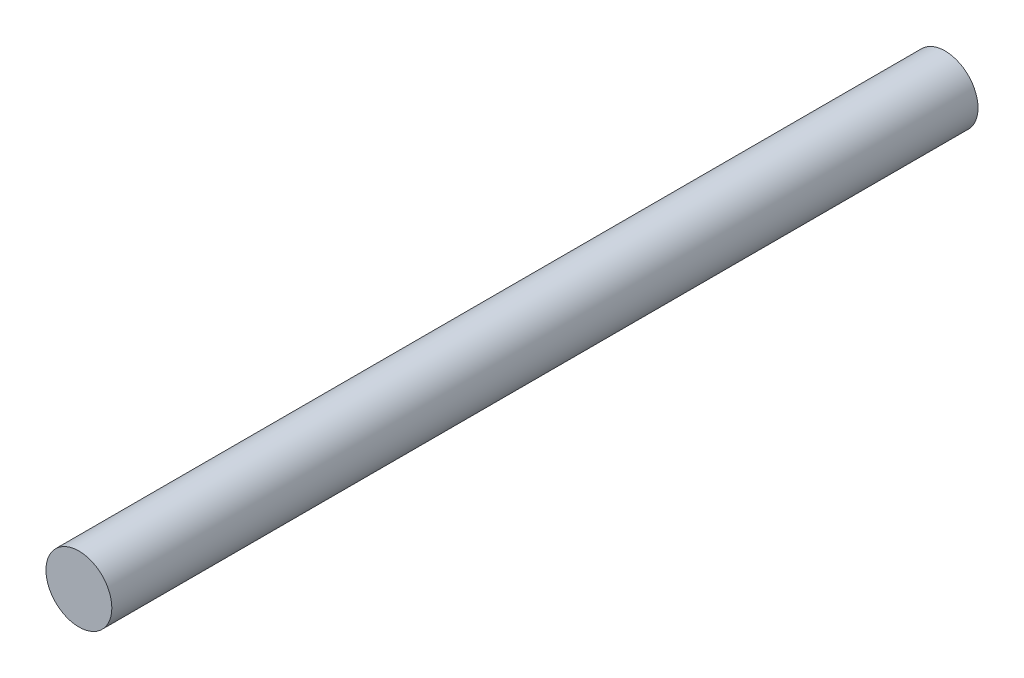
from build123d import *

# Parameters (mm, degrees)
ESQUISSE1_R      = 35
EXTRUSION1_DEPTH = 460


with BuildPart() as part:
    # Esquisse1 → Extrusion1 (new, symmetric)
    with BuildSketch(Plane.XY):
        Circle(ESQUISSE1_R)
    extrude(amount=EXTRUSION1_DEPTH, both=True)


solid = part.part
